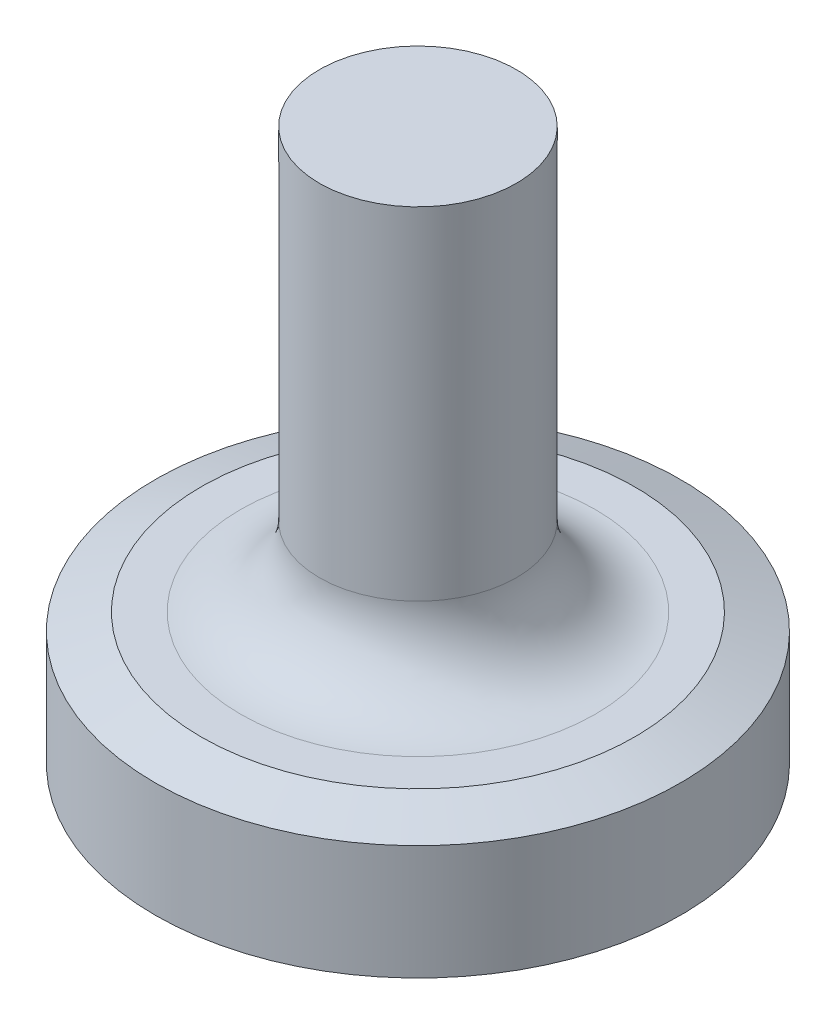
from build123d import *

# Parameters (mm, degrees)
FILLET_1_R = 30


with BuildPart() as part:
    # Sketch 1 → Revolve 1 (revolve)
    with BuildSketch(Plane(origin=(0, 0, 0), x_dir=(0, 0, -1), z_dir=(1, 0, 0)), mode=Mode.PRIVATE) as revolve_1_sk:
        Polygon((0, 210), (37.5, 210), (37.5, 50), (82.5, 50), (100, 43.6305209), (100, 0), (0, 0), align=None)
    revolve(revolve_1_sk.sketch.rotate(Axis((0, 124.896640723, 0), (0, -1, 0)), 180), axis=Axis((0, 124.896640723, 0), (0, -1, 0)))

    # Fillet 1
    fillet_1_edges = [part.edges().sort_by_distance(p)[0] for p in [
        (0, 50, -37.5),
    ]]
    fillet(fillet_1_edges, radius=FILLET_1_R)


solid = part.part
